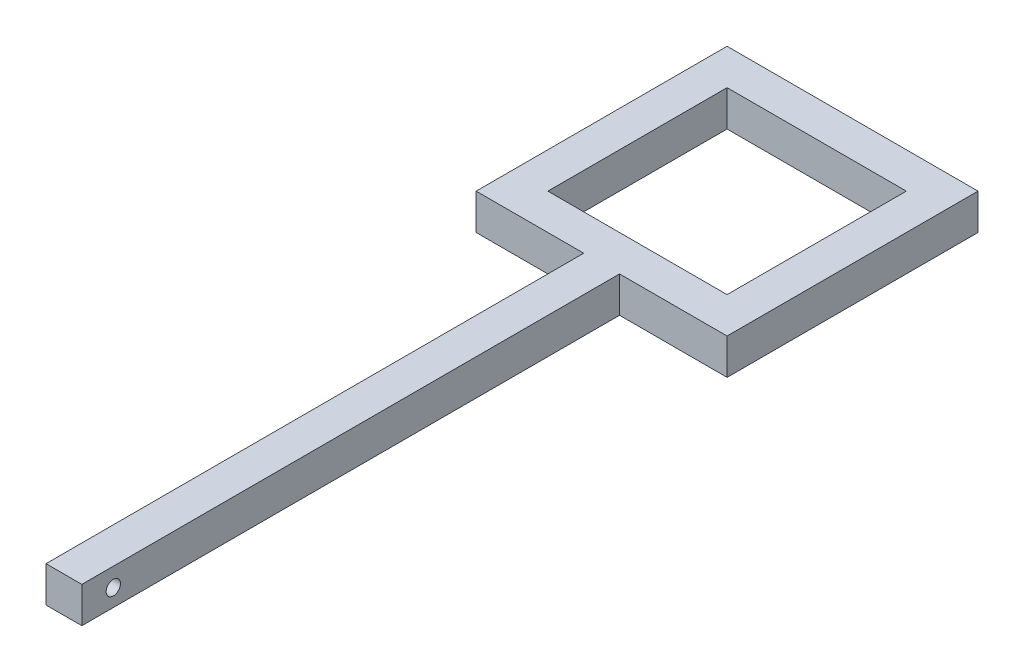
from build123d import *

# Parameters (mm, degrees)
SKETCH1_W           = 20
SKETCH1_H           = 300
BOSS_EXTRUDE1_DEPTH = 20
SKETCH2_W           = 140
SKETCH2_H           = 20
BOSS_EXTRUDE2_DEPTH = 20
SKETCH3_W           = 20
SKETCH3_H           = 20
BOSS_EXTRUDE3_DEPTH = 100
SKETCH4_W           = 140
SKETCH4_H           = 20
BOSS_EXTRUDE4_DEPTH = 20
SKETCH5_R           = 4
CUT_EXTRUDE1_DEPTH  = 20


with BuildPart() as part:
    # Sketch1 → Boss-Extrude1 (new body)
    with BuildSketch(Plane(origin=(0, 0, 0), x_dir=(1, 0, 0), z_dir=(0, 1, 0))):
        with Locations((10, 150)):
            Rectangle(SKETCH1_W, SKETCH1_H)
    extrude(amount=BOSS_EXTRUDE1_DEPTH)

    # Sketch2 → Boss-Extrude2 (add)
    with BuildSketch(Plane(origin=(0, 0, -300), x_dir=(-1, 0, 0), z_dir=(0, 0, -1))):
        with Locations((-10, 10)):
            Rectangle(SKETCH2_W, SKETCH2_H)
    extrude(amount=BOSS_EXTRUDE2_DEPTH)

    # Sketch3 → Boss-Extrude3 (add)
    with BuildSketch(Plane(origin=(0, 0, -320), x_dir=(-1, 0, 0), z_dir=(0, 0, -1))):
        with Locations((-70, 10)):
            Rectangle(SKETCH3_W, SKETCH3_H)
        with Locations((50, 10)):
            Rectangle(SKETCH3_W, SKETCH3_H)
    extrude(amount=BOSS_EXTRUDE3_DEPTH)

    # Sketch4 → Boss-Extrude4 (add)
    with BuildSketch(Plane(origin=(0, 0, -420), x_dir=(-1, 0, 0), z_dir=(0, 0, -1))):
        with Locations((-10, 10)):
            Rectangle(SKETCH4_W, SKETCH4_H)
    extrude(amount=BOSS_EXTRUDE4_DEPTH)

    # Sketch5 → Cut-Extrude1 (cut)
    with BuildSketch(Plane(origin=(20, 0, 0), x_dir=(0, 0, -1), z_dir=(1, 0, 0))):
        with Locations((17.553570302, 9.639225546)):
            Circle(SKETCH5_R)
    extrude(amount=-CUT_EXTRUDE1_DEPTH, mode=Mode.SUBTRACT)


solid = part.part
